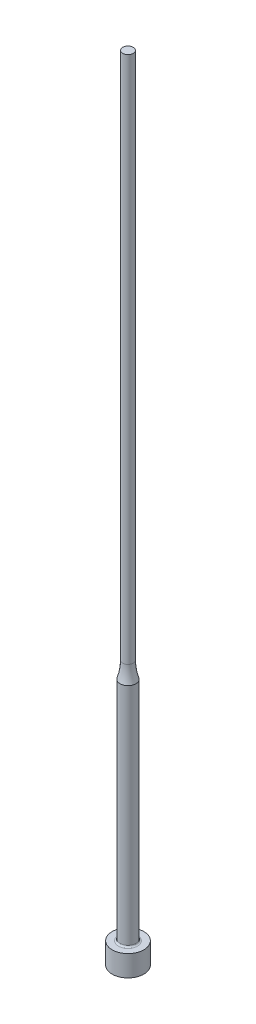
ISO-10303-21;
HEADER;
FILE_DESCRIPTION(('STEP AP214'),'2;1');
FILE_NAME('part.step','',(''),(''),'','','');
FILE_SCHEMA(('AUTOMOTIVE_DESIGN { 1 0 10303 214 1 1 1 1 }'));
ENDSEC;
DATA;
#1=APPLICATION_CONTEXT('core data for automotive mechanical design processes');
#2=APPLICATION_PROTOCOL_DEFINITION('international standard','automotive_design',2000,#1);
#3=PRODUCT_CONTEXT('',#1,'mechanical');
#4=PRODUCT('Part','Part','',(#3));
#5=PRODUCT_RELATED_PRODUCT_CATEGORY('part','',(#4));
#6=PRODUCT_DEFINITION_FORMATION('','',#4);
#7=PRODUCT_DEFINITION_CONTEXT('part definition',#1,'design');
#8=PRODUCT_DEFINITION('design','',#6,#7);
#9=PRODUCT_DEFINITION_SHAPE('','',#8);
#10=(LENGTH_UNIT() NAMED_UNIT(*) SI_UNIT(.MILLI.,.METRE.));
#11=(NAMED_UNIT(*) PLANE_ANGLE_UNIT() SI_UNIT($,.RADIAN.));
#12=(NAMED_UNIT(*) SI_UNIT($,.STERADIAN.) SOLID_ANGLE_UNIT());
#13=UNCERTAINTY_MEASURE_WITH_UNIT(LENGTH_MEASURE(1.E-05),#10,'distance_accuracy_value','');
#14=(GEOMETRIC_REPRESENTATION_CONTEXT(3) GLOBAL_UNCERTAINTY_ASSIGNED_CONTEXT((#13)) GLOBAL_UNIT_ASSIGNED_CONTEXT((#10,
#11,#12)) REPRESENTATION_CONTEXT('',''));
#15=CARTESIAN_POINT('',(0.,0.,0.));
#16=DIRECTION('',(0.,0.,1.));
#17=DIRECTION('',(1.,0.,0.));
#18=AXIS2_PLACEMENT_3D('',#15,#16,#17);
#19=CARTESIAN_POINT('',(1.00000000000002,150.,0.));
#20=DIRECTION('',(0.,-1.,0.));
#21=DIRECTION('',(1.,0.,0.));
#22=AXIS2_PLACEMENT_3D('',#19,#20,#21);
#23=PLANE('',#22);
#24=CARTESIAN_POINT('',(0.,150.,0.));
#25=DIRECTION('',(0.,1.,0.));
#26=DIRECTION('',(-1.,0.,0.));
#27=AXIS2_PLACEMENT_3D('',#24,#25,#26);
#28=CIRCLE('',#27,1.00000000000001);
#29=CARTESIAN_POINT('',(-1.00000000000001,150.,0.));
#30=VERTEX_POINT('',#29);
#31=EDGE_CURVE('E10',#30,#30,#28,.T.);
#32=ORIENTED_EDGE('',*,*,#31,.T.);
#33=EDGE_LOOP('',(#32));
#34=FACE_BOUND('',#33,.T.);
#35=ADVANCED_FACE('F30',(#34),#23,.F.);
#36=CARTESIAN_POINT('',(0.,150.,0.));
#37=DIRECTION('',(0.,1.,0.));
#38=DIRECTION('',(-1.,0.,0.));
#39=AXIS2_PLACEMENT_3D('',#36,#37,#38);
#40=CYLINDRICAL_SURFACE('',#39,1.00000000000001);
#41=ORIENTED_EDGE('',*,*,#31,.F.);
#42=EDGE_LOOP('',(#41));
#43=FACE_BOUND('',#42,.T.);
#44=CARTESIAN_POINT('',(0.,50.,0.));
#45=DIRECTION('',(0.,1.,0.));
#46=DIRECTION('',(-1.,0.,0.));
#47=AXIS2_PLACEMENT_3D('',#44,#45,#46);
#48=CIRCLE('',#47,1.00000000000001);
#49=CARTESIAN_POINT('',(-1.00000000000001,50.,0.));
#50=VERTEX_POINT('',#49);
#51=EDGE_CURVE('E36',#50,#50,#48,.T.);
#52=ORIENTED_EDGE('',*,*,#51,.T.);
#53=EDGE_LOOP('',(#52));
#54=FACE_BOUND('',#53,.T.);
#55=ADVANCED_FACE('F71',(#43,#54),#40,.T.);
#56=CARTESIAN_POINT('',(0.,50.,0.));
#57=DIRECTION('',(0.,1.,0.));
#58=DIRECTION('',(-1.,0.,0.));
#59=AXIS2_PLACEMENT_3D('',#56,#57,#58);
#60=TOROIDAL_SURFACE('',#59,11.,10.);
#61=ORIENTED_EDGE('',*,*,#51,.F.);
#62=EDGE_LOOP('',(#61));
#63=FACE_BOUND('',#62,.T.);
#64=CARTESIAN_POINT('',(0.,46.8775010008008,0.));
#65=DIRECTION('',(0.,1.,0.));
#66=DIRECTION('',(-1.,0.,0.));
#67=AXIS2_PLACEMENT_3D('',#64,#65,#66);
#68=CIRCLE('',#67,1.50000000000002);
#69=CARTESIAN_POINT('',(-1.50000000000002,46.8775010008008,0.));
#70=VERTEX_POINT('',#69);
#71=EDGE_CURVE('E40',#70,#70,#68,.T.);
#72=ORIENTED_EDGE('',*,*,#71,.T.);
#73=EDGE_LOOP('',(#72));
#74=FACE_BOUND('',#73,.T.);
#75=ADVANCED_FACE('F75',(#63,#74),#60,.F.);
#76=CARTESIAN_POINT('',(0.,150.,0.));
#77=DIRECTION('',(0.,1.,0.));
#78=DIRECTION('',(-1.,0.,0.));
#79=AXIS2_PLACEMENT_3D('',#76,#77,#78);
#80=CYLINDRICAL_SURFACE('',#79,1.50000000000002);
#81=ORIENTED_EDGE('',*,*,#71,.F.);
#82=EDGE_LOOP('',(#81));
#83=FACE_BOUND('',#82,.T.);
#84=CARTESIAN_POINT('',(0.,4.3,0.));
#85=DIRECTION('',(0.,1.,0.));
#86=DIRECTION('',(-1.,0.,0.));
#87=AXIS2_PLACEMENT_3D('',#84,#85,#86);
#88=CIRCLE('',#87,1.50000000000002);
#89=CARTESIAN_POINT('',(-1.50000000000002,4.3,0.));
#90=VERTEX_POINT('',#89);
#91=EDGE_CURVE('E44',#90,#90,#88,.T.);
#92=ORIENTED_EDGE('',*,*,#91,.T.);
#93=EDGE_LOOP('',(#92));
#94=FACE_BOUND('',#93,.T.);
#95=ADVANCED_FACE('F80',(#83,#94),#80,.T.);
#96=CARTESIAN_POINT('',(0.,4.3,0.));
#97=DIRECTION('',(0.,1.,0.));
#98=DIRECTION('',(-1.,0.,0.));
#99=AXIS2_PLACEMENT_3D('',#96,#97,#98);
#100=TOROIDAL_SURFACE('',#99,1.80000000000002,0.3);
#101=ORIENTED_EDGE('',*,*,#91,.F.);
#102=EDGE_LOOP('',(#101));
#103=FACE_BOUND('',#102,.T.);
#104=CARTESIAN_POINT('',(0.,4.,0.));
#105=DIRECTION('',(0.,1.,0.));
#106=DIRECTION('',(-1.,0.,0.));
#107=AXIS2_PLACEMENT_3D('',#104,#105,#106);
#108=CIRCLE('',#107,1.80000000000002);
#109=CARTESIAN_POINT('',(-1.80000000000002,4.,0.));
#110=VERTEX_POINT('',#109);
#111=EDGE_CURVE('E49',#110,#110,#108,.T.);
#112=ORIENTED_EDGE('',*,*,#111,.T.);
#113=EDGE_LOOP('',(#112));
#114=FACE_BOUND('',#113,.T.);
#115=ADVANCED_FACE('F86',(#103,#114),#100,.F.);
#116=CARTESIAN_POINT('',(3.00000000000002,4.,0.));
#117=DIRECTION('',(0.,-1.,0.));
#118=DIRECTION('',(1.,0.,0.));
#119=AXIS2_PLACEMENT_3D('',#116,#117,#118);
#120=PLANE('',#119);
#121=ORIENTED_EDGE('',*,*,#111,.F.);
#122=EDGE_LOOP('',(#121));
#123=FACE_BOUND('',#122,.T.);
#124=CARTESIAN_POINT('',(0.,4.,0.));
#125=DIRECTION('',(0.,1.,0.));
#126=DIRECTION('',(-1.,0.,0.));
#127=AXIS2_PLACEMENT_3D('',#124,#125,#126);
#128=CIRCLE('',#127,3.00000000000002);
#129=CARTESIAN_POINT('',(-3.00000000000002,4.,0.));
#130=VERTEX_POINT('',#129);
#131=EDGE_CURVE('E52',#130,#130,#128,.T.);
#132=ORIENTED_EDGE('',*,*,#131,.T.);
#133=EDGE_LOOP('',(#132));
#134=FACE_BOUND('',#133,.T.);
#135=ADVANCED_FACE('F67',(#123,#134),#120,.F.);
#136=CARTESIAN_POINT('',(0.,150.,0.));
#137=DIRECTION('',(0.,1.,0.));
#138=DIRECTION('',(-1.,0.,0.));
#139=AXIS2_PLACEMENT_3D('',#136,#137,#138);
#140=CYLINDRICAL_SURFACE('',#139,3.00000000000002);
#141=ORIENTED_EDGE('',*,*,#131,.F.);
#142=EDGE_LOOP('',(#141));
#143=FACE_BOUND('',#142,.T.);
#144=CARTESIAN_POINT('',(0.,0.,0.));
#145=DIRECTION('',(0.,1.,0.));
#146=DIRECTION('',(-1.,0.,0.));
#147=AXIS2_PLACEMENT_3D('',#144,#145,#146);
#148=CIRCLE('',#147,3.00000000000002);
#149=CARTESIAN_POINT('',(-3.00000000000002,0.,0.));
#150=VERTEX_POINT('',#149);
#151=EDGE_CURVE('E55',#150,#150,#148,.T.);
#152=ORIENTED_EDGE('',*,*,#151,.T.);
#153=EDGE_LOOP('',(#152));
#154=FACE_BOUND('',#153,.T.);
#155=ADVANCED_FACE('F59',(#143,#154),#140,.T.);
#156=CARTESIAN_POINT('',(0.,0.,0.));
#157=DIRECTION('',(0.,1.,0.));
#158=DIRECTION('',(-1.,0.,0.));
#159=AXIS2_PLACEMENT_3D('',#156,#157,#158);
#160=PLANE('',#159);
#161=ORIENTED_EDGE('',*,*,#151,.F.);
#162=EDGE_LOOP('',(#161));
#163=FACE_BOUND('',#162,.T.);
#164=ADVANCED_FACE('F61',(#163),#160,.F.);
#165=CLOSED_SHELL('',(#35,#55,#75,#95,#115,#135,#155,#164));
#166=MANIFOLD_SOLID_BREP('B2',#165);
#167=ADVANCED_BREP_SHAPE_REPRESENTATION('',(#18,#166),#14);
#168=SHAPE_DEFINITION_REPRESENTATION(#9,#167);
ENDSEC;
END-ISO-10303-21;
